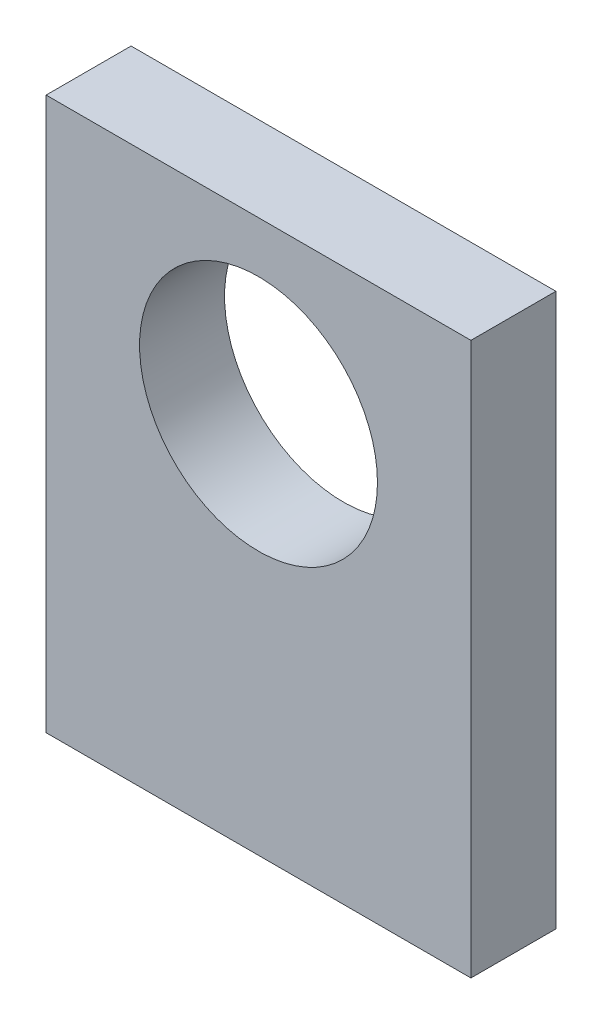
from build123d import *

# Parameters (mm, degrees)
SKETCH_4_W                  = 50
SKETCH_4_H                  = 65
EXTRUDE_2_DEPTH             = 10
HOLE_WIZARD_28_0_28_1_D     = 28
HOLE_WIZARD_28_0_28_1_DEPTH = 10
HOLE_WIZARD_28_0_28_1_TIP   = 8.412048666
HOLE_WIZARD_M51_D           = 4.2
HOLE_WIZARD_M51_DEPTH       = 14
HOLE_WIZARD_M51_TIP         = 1.2618073


with BuildPart() as part:
    # Sketch 4 → Extrude 2 (new body)
    with BuildSketch(Plane.XY):
        Rectangle(SKETCH_4_W, SKETCH_4_H)
    extrude(amount=EXTRUDE_2_DEPTH)

    # Hole Wizard 28.0 _28_1
    with Locations(Plane.XY.offset(10)):
        with Locations((0, 12.5)):
            Hole(HOLE_WIZARD_28_0_28_1_D / 2, depth=HOLE_WIZARD_28_0_28_1_DEPTH)
            with Locations((0, 0, -(HOLE_WIZARD_28_0_28_1_DEPTH + HOLE_WIZARD_28_0_28_1_TIP / 2))):  # 118° drill point
                Cone(0, HOLE_WIZARD_28_0_28_1_D / 2, HOLE_WIZARD_28_0_28_1_TIP, mode=Mode.SUBTRACT)

    # Hole Wizard M51
    with Locations(Plane(origin=(0, -32.5, 0), x_dir=(-1, 0, 0), z_dir=(0, -1, 0))):
        with Locations((20.75, -5), (-20.75, -5)):
            Hole(HOLE_WIZARD_M51_D / 2, depth=HOLE_WIZARD_M51_DEPTH)
            with Locations((0, 0, -(HOLE_WIZARD_M51_DEPTH + HOLE_WIZARD_M51_TIP / 2))):  # 118° drill point
                Cone(0, HOLE_WIZARD_M51_D / 2, HOLE_WIZARD_M51_TIP, mode=Mode.SUBTRACT)


solid = part.part
